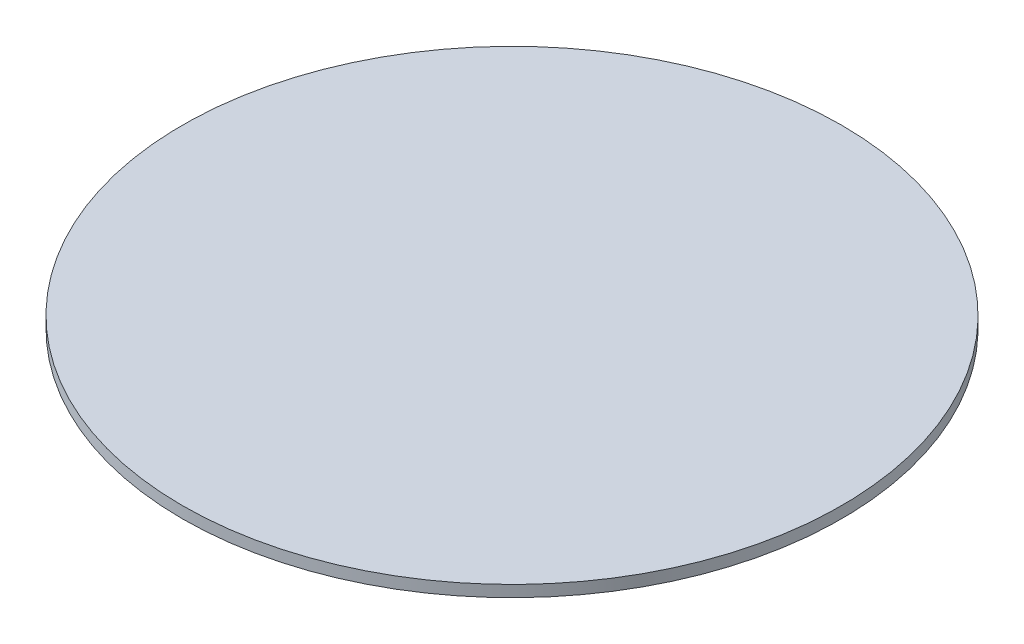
ISO-10303-21;
HEADER;
FILE_DESCRIPTION(('STEP AP214'),'2;1');
FILE_NAME('part.step','',(''),(''),'','','');
FILE_SCHEMA(('AUTOMOTIVE_DESIGN { 1 0 10303 214 1 1 1 1 }'));
ENDSEC;
DATA;
#1=APPLICATION_CONTEXT('core data for automotive mechanical design processes');
#2=APPLICATION_PROTOCOL_DEFINITION('international standard','automotive_design',2000,#1);
#3=PRODUCT_CONTEXT('',#1,'mechanical');
#4=PRODUCT('Part','Part','',(#3));
#5=PRODUCT_RELATED_PRODUCT_CATEGORY('part','',(#4));
#6=PRODUCT_DEFINITION_FORMATION('','',#4);
#7=PRODUCT_DEFINITION_CONTEXT('part definition',#1,'design');
#8=PRODUCT_DEFINITION('design','',#6,#7);
#9=PRODUCT_DEFINITION_SHAPE('','',#8);
#10=(LENGTH_UNIT() NAMED_UNIT(*) SI_UNIT(.MILLI.,.METRE.));
#11=(NAMED_UNIT(*) PLANE_ANGLE_UNIT() SI_UNIT($,.RADIAN.));
#12=(NAMED_UNIT(*) SI_UNIT($,.STERADIAN.) SOLID_ANGLE_UNIT());
#13=UNCERTAINTY_MEASURE_WITH_UNIT(LENGTH_MEASURE(1.E-05),#10,'distance_accuracy_value','');
#14=(GEOMETRIC_REPRESENTATION_CONTEXT(3) GLOBAL_UNCERTAINTY_ASSIGNED_CONTEXT((#13)) GLOBAL_UNIT_ASSIGNED_CONTEXT((#10,
#11,#12)) REPRESENTATION_CONTEXT('',''));
#15=CARTESIAN_POINT('',(0.,0.,0.));
#16=DIRECTION('',(0.,0.,1.));
#17=DIRECTION('',(1.,0.,0.));
#18=AXIS2_PLACEMENT_3D('',#15,#16,#17);
#19=CARTESIAN_POINT('',(0.,16.,0.));
#20=DIRECTION('',(0.,-1.,0.));
#21=DIRECTION('',(0.,0.,-1.));
#22=AXIS2_PLACEMENT_3D('',#19,#20,#21);
#23=CYLINDRICAL_SURFACE('',#22,460.);
#24=CARTESIAN_POINT('',(0.,16.,0.));
#25=DIRECTION('',(0.,1.,0.));
#26=DIRECTION('',(0.,0.,1.));
#27=AXIS2_PLACEMENT_3D('',#24,#25,#26);
#28=CIRCLE('',#27,460.);
#29=CARTESIAN_POINT('',(0.,16.,460.));
#30=VERTEX_POINT('',#29);
#31=EDGE_CURVE('E10',#30,#30,#28,.T.);
#32=ORIENTED_EDGE('',*,*,#31,.F.);
#33=EDGE_LOOP('',(#32));
#34=FACE_BOUND('',#33,.T.);
#35=CARTESIAN_POINT('',(0.,0.,0.));
#36=DIRECTION('',(0.,1.,0.));
#37=DIRECTION('',(0.,0.,1.));
#38=AXIS2_PLACEMENT_3D('',#35,#36,#37);
#39=CIRCLE('',#38,460.);
#40=CARTESIAN_POINT('',(0.,0.,460.));
#41=VERTEX_POINT('',#40);
#42=EDGE_CURVE('E34',#41,#41,#39,.T.);
#43=ORIENTED_EDGE('',*,*,#42,.T.);
#44=EDGE_LOOP('',(#43));
#45=FACE_BOUND('',#44,.T.);
#46=ADVANCED_FACE('F31',(#34,#45),#23,.T.);
#47=CARTESIAN_POINT('',(0.,16.,0.));
#48=DIRECTION('',(0.,1.,0.));
#49=DIRECTION('',(0.,0.,1.));
#50=AXIS2_PLACEMENT_3D('',#47,#48,#49);
#51=PLANE('',#50);
#52=ORIENTED_EDGE('',*,*,#31,.T.);
#53=EDGE_LOOP('',(#52));
#54=FACE_BOUND('',#53,.T.);
#55=ADVANCED_FACE('F46',(#54),#51,.T.);
#56=CARTESIAN_POINT('',(0.,0.,0.));
#57=DIRECTION('',(0.,1.,0.));
#58=DIRECTION('',(0.,0.,1.));
#59=AXIS2_PLACEMENT_3D('',#56,#57,#58);
#60=PLANE('',#59);
#61=ORIENTED_EDGE('',*,*,#42,.F.);
#62=EDGE_LOOP('',(#61));
#63=FACE_BOUND('',#62,.T.);
#64=ADVANCED_FACE('F44',(#63),#60,.F.);
#65=CLOSED_SHELL('',(#46,#55,#64));
#66=MANIFOLD_SOLID_BREP('B2',#65);
#67=ADVANCED_BREP_SHAPE_REPRESENTATION('',(#18,#66),#14);
#68=SHAPE_DEFINITION_REPRESENTATION(#9,#67);
ENDSEC;
END-ISO-10303-21;
